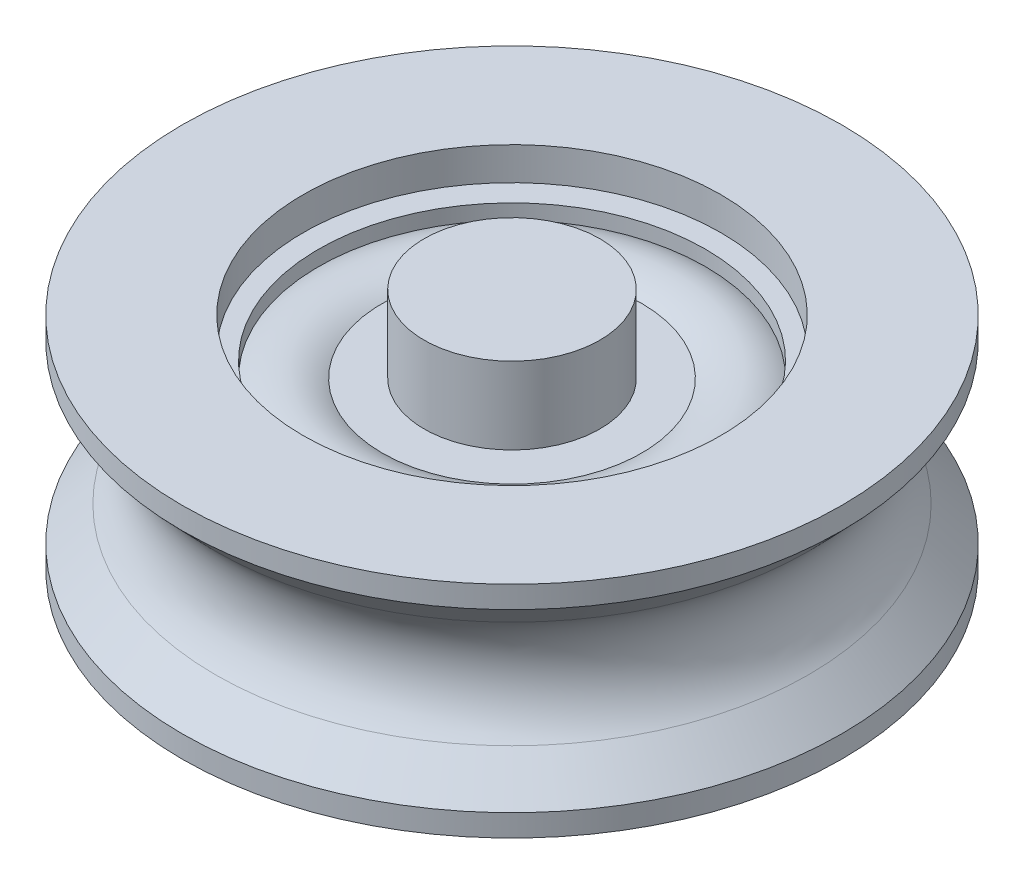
ISO-10303-21;
HEADER;
FILE_DESCRIPTION(('STEP AP214'),'2;1');
FILE_NAME('part.step','',(''),(''),'','','');
FILE_SCHEMA(('AUTOMOTIVE_DESIGN { 1 0 10303 214 1 1 1 1 }'));
ENDSEC;
DATA;
#1=APPLICATION_CONTEXT('core data for automotive mechanical design processes');
#2=APPLICATION_PROTOCOL_DEFINITION('international standard','automotive_design',2000,#1);
#3=PRODUCT_CONTEXT('',#1,'mechanical');
#4=PRODUCT('Part','Part','',(#3));
#5=PRODUCT_RELATED_PRODUCT_CATEGORY('part','',(#4));
#6=PRODUCT_DEFINITION_FORMATION('','',#4);
#7=PRODUCT_DEFINITION_CONTEXT('part definition',#1,'design');
#8=PRODUCT_DEFINITION('design','',#6,#7);
#9=PRODUCT_DEFINITION_SHAPE('','',#8);
#10=(LENGTH_UNIT() NAMED_UNIT(*) SI_UNIT(.MILLI.,.METRE.));
#11=(NAMED_UNIT(*) PLANE_ANGLE_UNIT() SI_UNIT($,.RADIAN.));
#12=(NAMED_UNIT(*) SI_UNIT($,.STERADIAN.) SOLID_ANGLE_UNIT());
#13=UNCERTAINTY_MEASURE_WITH_UNIT(LENGTH_MEASURE(1.E-05),#10,'distance_accuracy_value','');
#14=(GEOMETRIC_REPRESENTATION_CONTEXT(3) GLOBAL_UNCERTAINTY_ASSIGNED_CONTEXT((#13)) GLOBAL_UNIT_ASSIGNED_CONTEXT((#10,
#11,#12)) REPRESENTATION_CONTEXT('',''));
#15=CARTESIAN_POINT('',(0.,0.,0.));
#16=DIRECTION('',(0.,0.,1.));
#17=DIRECTION('',(1.,0.,0.));
#18=AXIS2_PLACEMENT_3D('',#15,#16,#17);
#19=CARTESIAN_POINT('',(0.,-4.48852632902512,0.));
#20=DIRECTION('',(0.,-1.,0.));
#21=DIRECTION('',(0.,0.,-1.));
#22=AXIS2_PLACEMENT_3D('',#19,#20,#21);
#23=PLANE('',#22);
#24=CARTESIAN_POINT('',(0.,-4.48852632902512,0.));
#25=DIRECTION('',(0.,-1.,0.));
#26=DIRECTION('',(0.,0.,-1.));
#27=AXIS2_PLACEMENT_3D('',#24,#25,#26);
#28=CIRCLE('',#27,4.);
#29=CARTESIAN_POINT('',(0.,-4.48852632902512,-4.));
#30=VERTEX_POINT('',#29);
#31=EDGE_CURVE('E18',#30,#30,#28,.F.);
#32=ORIENTED_EDGE('',*,*,#31,.F.);
#33=EDGE_LOOP('',(#32));
#34=FACE_BOUND('',#33,.T.);
#35=ADVANCED_FACE('F14',(#34),#23,.T.);
#36=CARTESIAN_POINT('',(-47.6713019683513,6.01147367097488,-52.2101334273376));
#37=DIRECTION('',(0.,-1.,0.));
#38=DIRECTION('',(0.,0.,-1.));
#39=AXIS2_PLACEMENT_3D('',#36,#37,#38);
#40=PLANE('',#39);
#41=CARTESIAN_POINT('',(0.,6.01147367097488,0.));
#42=DIRECTION('',(0.,-1.,0.));
#43=DIRECTION('',(0.,0.,-1.));
#44=AXIS2_PLACEMENT_3D('',#41,#42,#43);
#45=CIRCLE('',#44,4.);
#46=CARTESIAN_POINT('',(0.,6.01147367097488,-4.));
#47=VERTEX_POINT('',#46);
#48=EDGE_CURVE('E179',#47,#47,#45,.T.);
#49=ORIENTED_EDGE('',*,*,#48,.F.);
#50=EDGE_LOOP('',(#49));
#51=FACE_BOUND('',#50,.T.);
#52=ADVANCED_FACE('F87',(#51),#40,.F.);
#53=CARTESIAN_POINT('',(0.,0.76147367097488,0.));
#54=DIRECTION('',(0.,-1.,0.));
#55=DIRECTION('',(0.,0.,-1.));
#56=AXIS2_PLACEMENT_3D('',#53,#54,#55);
#57=CYLINDRICAL_SURFACE('',#56,4.);
#58=CARTESIAN_POINT('',(0.,-2.51147367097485,0.));
#59=DIRECTION('',(0.,-1.,0.));
#60=DIRECTION('',(0.,0.,-1.));
#61=AXIS2_PLACEMENT_3D('',#58,#59,#60);
#62=CIRCLE('',#61,4.);
#63=CARTESIAN_POINT('',(0.,-2.51147367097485,-4.));
#64=VERTEX_POINT('',#63);
#65=EDGE_CURVE('E177',#64,#64,#62,.F.);
#66=ORIENTED_EDGE('',*,*,#65,.F.);
#67=EDGE_LOOP('',(#66));
#68=FACE_BOUND('',#67,.T.);
#69=ORIENTED_EDGE('',*,*,#31,.T.);
#70=EDGE_LOOP('',(#69));
#71=FACE_BOUND('',#70,.T.);
#72=ADVANCED_FACE('F83',(#68,#71),#57,.T.);
#73=CARTESIAN_POINT('',(0.,0.76147367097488,0.));
#74=DIRECTION('',(0.,-1.,0.));
#75=DIRECTION('',(0.,0.,-1.));
#76=AXIS2_PLACEMENT_3D('',#73,#74,#75);
#77=CYLINDRICAL_SURFACE('',#76,4.);
#78=CARTESIAN_POINT('',(0.,2.51147367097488,0.));
#79=DIRECTION('',(0.,-1.,0.));
#80=DIRECTION('',(0.,0.,-1.));
#81=AXIS2_PLACEMENT_3D('',#78,#79,#80);
#82=CIRCLE('',#81,4.);
#83=CARTESIAN_POINT('',(0.,2.51147367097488,-4.));
#84=VERTEX_POINT('',#83);
#85=EDGE_CURVE('E174',#84,#84,#82,.T.);
#86=ORIENTED_EDGE('',*,*,#85,.F.);
#87=EDGE_LOOP('',(#86));
#88=FACE_BOUND('',#87,.T.);
#89=ORIENTED_EDGE('',*,*,#48,.T.);
#90=EDGE_LOOP('',(#89));
#91=FACE_BOUND('',#90,.T.);
#92=ADVANCED_FACE('F79',(#88,#91),#77,.T.);
#93=CARTESIAN_POINT('',(0.,-2.51147367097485,4.94999999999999));
#94=DIRECTION('',(0.,-1.,0.));
#95=DIRECTION('',(0.,0.,-1.));
#96=AXIS2_PLACEMENT_3D('',#93,#94,#95);
#97=PLANE('',#96);
#98=ORIENTED_EDGE('',*,*,#65,.T.);
#99=EDGE_LOOP('',(#98));
#100=FACE_BOUND('',#99,.T.);
#101=CARTESIAN_POINT('',(0.,-2.51147367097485,0.));
#102=DIRECTION('',(0.,-1.,0.));
#103=DIRECTION('',(0.,0.,-1.));
#104=AXIS2_PLACEMENT_3D('',#101,#102,#103);
#105=CIRCLE('',#104,5.89999999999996);
#106=CARTESIAN_POINT('',(0.,-2.51147367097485,-5.89999999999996));
#107=VERTEX_POINT('',#106);
#108=EDGE_CURVE('E171',#107,#107,#105,.F.);
#109=ORIENTED_EDGE('',*,*,#108,.F.);
#110=EDGE_LOOP('',(#109));
#111=FACE_BOUND('',#110,.T.);
#112=ADVANCED_FACE('F75',(#100,#111),#97,.T.);
#113=CARTESIAN_POINT('',(0.,2.51147367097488,4.95));
#114=DIRECTION('',(0.,1.,0.));
#115=DIRECTION('',(0.,0.,1.));
#116=AXIS2_PLACEMENT_3D('',#113,#114,#115);
#117=PLANE('',#116);
#118=ORIENTED_EDGE('',*,*,#85,.T.);
#119=EDGE_LOOP('',(#118));
#120=FACE_BOUND('',#119,.T.);
#121=CARTESIAN_POINT('',(0.,2.51147367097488,0.));
#122=DIRECTION('',(0.,-1.,0.));
#123=DIRECTION('',(0.,0.,-1.));
#124=AXIS2_PLACEMENT_3D('',#121,#122,#123);
#125=CIRCLE('',#124,5.9);
#126=CARTESIAN_POINT('',(0.,2.51147367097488,-5.9));
#127=VERTEX_POINT('',#126);
#128=EDGE_CURVE('E53',#127,#127,#125,.T.);
#129=ORIENTED_EDGE('',*,*,#128,.F.);
#130=EDGE_LOOP('',(#129));
#131=FACE_BOUND('',#130,.T.);
#132=ADVANCED_FACE('F71',(#120,#131),#117,.T.);
#133=CARTESIAN_POINT('',(0.,0.,0.));
#134=DIRECTION('',(0.,-1.,0.));
#135=DIRECTION('',(1.,0.,0.));
#136=AXIS2_PLACEMENT_3D('',#133,#134,#135);
#137=TOROIDAL_SURFACE('',#136,7.34999999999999,2.89999999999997);
#138=ORIENTED_EDGE('',*,*,#108,.T.);
#139=EDGE_LOOP('',(#138));
#140=FACE_BOUND('',#139,.T.);
#141=CARTESIAN_POINT('',(0.,-2.51147367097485,0.));
#142=DIRECTION('',(0.,-1.,0.));
#143=DIRECTION('',(0.,0.,-1.));
#144=AXIS2_PLACEMENT_3D('',#141,#142,#143);
#145=CIRCLE('',#144,8.79999999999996);
#146=CARTESIAN_POINT('',(0.,-2.51147367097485,-8.79999999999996));
#147=VERTEX_POINT('',#146);
#148=EDGE_CURVE('E48',#147,#147,#145,.T.);
#149=ORIENTED_EDGE('',*,*,#148,.T.);
#150=EDGE_LOOP('',(#149));
#151=FACE_BOUND('',#150,.T.);
#152=ADVANCED_FACE('F66',(#140,#151),#137,.T.);
#153=CARTESIAN_POINT('',(0.,0.,0.));
#154=DIRECTION('',(0.,-1.,0.));
#155=DIRECTION('',(1.,0.,0.));
#156=AXIS2_PLACEMENT_3D('',#153,#154,#155);
#157=TOROIDAL_SURFACE('',#156,7.34999999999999,2.89999999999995);
#158=CARTESIAN_POINT('',(0.,2.51147367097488,0.));
#159=DIRECTION('',(0.,-1.,0.));
#160=DIRECTION('',(0.,0.,-1.));
#161=AXIS2_PLACEMENT_3D('',#158,#159,#160);
#162=CIRCLE('',#161,8.79999999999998);
#163=CARTESIAN_POINT('',(0.,2.51147367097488,-8.79999999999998));
#164=VERTEX_POINT('',#163);
#165=EDGE_CURVE('E44',#164,#164,#162,.F.);
#166=ORIENTED_EDGE('',*,*,#165,.T.);
#167=EDGE_LOOP('',(#166));
#168=FACE_BOUND('',#167,.T.);
#169=ORIENTED_EDGE('',*,*,#128,.T.);
#170=EDGE_LOOP('',(#169));
#171=FACE_BOUND('',#170,.T.);
#172=ADVANCED_FACE('F61',(#168,#171),#157,.T.);
#173=CARTESIAN_POINT('',(0.,-2.85573683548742,0.));
#174=DIRECTION('',(0.,-1.,0.));
#175=DIRECTION('',(0.,0.,-1.));
#176=AXIS2_PLACEMENT_3D('',#173,#174,#175);
#177=CYLINDRICAL_SURFACE('',#176,8.79999999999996);
#178=CARTESIAN_POINT('',(0.,-3.19999999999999,0.));
#179=DIRECTION('',(0.,-1.,0.));
#180=DIRECTION('',(0.,0.,-1.));
#181=AXIS2_PLACEMENT_3D('',#178,#179,#180);
#182=CIRCLE('',#181,8.79999999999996);
#183=CARTESIAN_POINT('',(0.,-3.19999999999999,-8.79999999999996));
#184=VERTEX_POINT('',#183);
#185=EDGE_CURVE('E47',#184,#184,#182,.F.);
#186=ORIENTED_EDGE('',*,*,#185,.F.);
#187=EDGE_LOOP('',(#186));
#188=FACE_BOUND('',#187,.T.);
#189=ORIENTED_EDGE('',*,*,#148,.F.);
#190=EDGE_LOOP('',(#189));
#191=FACE_BOUND('',#190,.T.);
#192=ADVANCED_FACE('F65',(#188,#191),#177,.F.);
#193=CARTESIAN_POINT('',(0.,2.85573683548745,0.));
#194=DIRECTION('',(0.,-1.,0.));
#195=DIRECTION('',(0.,0.,-1.));
#196=AXIS2_PLACEMENT_3D('',#193,#194,#195);
#197=CYLINDRICAL_SURFACE('',#196,8.79999999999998);
#198=ORIENTED_EDGE('',*,*,#165,.F.);
#199=EDGE_LOOP('',(#198));
#200=FACE_BOUND('',#199,.T.);
#201=CARTESIAN_POINT('',(0.,3.20000000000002,0.));
#202=DIRECTION('',(0.,-1.,0.));
#203=DIRECTION('',(0.,0.,-1.));
#204=AXIS2_PLACEMENT_3D('',#201,#202,#203);
#205=CIRCLE('',#204,8.79999999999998);
#206=CARTESIAN_POINT('',(0.,3.20000000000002,-8.79999999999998));
#207=VERTEX_POINT('',#206);
#208=EDGE_CURVE('E164',#207,#207,#205,.T.);
#209=ORIENTED_EDGE('',*,*,#208,.F.);
#210=EDGE_LOOP('',(#209));
#211=FACE_BOUND('',#210,.T.);
#212=ADVANCED_FACE('F193',(#200,#211),#197,.F.);
#213=CARTESIAN_POINT('',(0.,-3.19999999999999,9.89999999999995));
#214=DIRECTION('',(0.,-1.,0.));
#215=DIRECTION('',(0.,0.,-1.));
#216=AXIS2_PLACEMENT_3D('',#213,#214,#215);
#217=PLANE('',#216);
#218=ORIENTED_EDGE('',*,*,#185,.T.);
#219=EDGE_LOOP('',(#218));
#220=FACE_BOUND('',#219,.T.);
#221=CARTESIAN_POINT('',(0.,-3.19999999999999,0.));
#222=DIRECTION('',(0.,-1.,0.));
#223=DIRECTION('',(0.,0.,-1.));
#224=AXIS2_PLACEMENT_3D('',#221,#222,#223);
#225=CIRCLE('',#224,10.9999999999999);
#226=CARTESIAN_POINT('',(0.,-3.19999999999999,-10.9999999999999));
#227=VERTEX_POINT('',#226);
#228=EDGE_CURVE('E161',#227,#227,#225,.F.);
#229=ORIENTED_EDGE('',*,*,#228,.F.);
#230=EDGE_LOOP('',(#229));
#231=FACE_BOUND('',#230,.T.);
#232=ADVANCED_FACE('F198',(#220,#231),#217,.T.);
#233=CARTESIAN_POINT('',(0.,3.20000000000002,9.89999999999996));
#234=DIRECTION('',(0.,1.,0.));
#235=DIRECTION('',(0.,0.,1.));
#236=AXIS2_PLACEMENT_3D('',#233,#234,#235);
#237=PLANE('',#236);
#238=ORIENTED_EDGE('',*,*,#208,.T.);
#239=EDGE_LOOP('',(#238));
#240=FACE_BOUND('',#239,.T.);
#241=CARTESIAN_POINT('',(0.,3.20000000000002,0.));
#242=DIRECTION('',(0.,-1.,0.));
#243=DIRECTION('',(0.,0.,-1.));
#244=AXIS2_PLACEMENT_3D('',#241,#242,#243);
#245=CIRCLE('',#244,11.);
#246=CARTESIAN_POINT('',(0.,3.20000000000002,-11.));
#247=VERTEX_POINT('',#246);
#248=EDGE_CURVE('E159',#247,#247,#245,.T.);
#249=ORIENTED_EDGE('',*,*,#248,.F.);
#250=EDGE_LOOP('',(#249));
#251=FACE_BOUND('',#250,.T.);
#252=ADVANCED_FACE('F98',(#240,#251),#237,.T.);
#253=CARTESIAN_POINT('',(0.,-3.19999999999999,0.));
#254=DIRECTION('',(0.,-1.,0.));
#255=DIRECTION('',(0.,0.,-1.));
#256=AXIS2_PLACEMENT_3D('',#253,#254,#255);
#257=TOROIDAL_SURFACE('',#256,10.6999999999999,0.299999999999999);
#258=CARTESIAN_POINT('',(0.,-3.49999999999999,0.));
#259=DIRECTION('',(0.,-1.,0.));
#260=DIRECTION('',(0.,0.,-1.));
#261=AXIS2_PLACEMENT_3D('',#258,#259,#260);
#262=CIRCLE('',#261,10.6999999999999);
#263=CARTESIAN_POINT('',(0.,-3.49999999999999,-10.6999999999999));
#264=VERTEX_POINT('',#263);
#265=EDGE_CURVE('E156',#264,#264,#262,.F.);
#266=ORIENTED_EDGE('',*,*,#265,.F.);
#267=EDGE_LOOP('',(#266));
#268=FACE_BOUND('',#267,.T.);
#269=ORIENTED_EDGE('',*,*,#228,.T.);
#270=EDGE_LOOP('',(#269));
#271=FACE_BOUND('',#270,.T.);
#272=ADVANCED_FACE('F95',(#268,#271),#257,.F.);
#273=CARTESIAN_POINT('',(0.,3.20000000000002,0.));
#274=DIRECTION('',(0.,-1.,0.));
#275=DIRECTION('',(0.,0.,-1.));
#276=AXIS2_PLACEMENT_3D('',#273,#274,#275);
#277=TOROIDAL_SURFACE('',#276,10.7,0.30000000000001);
#278=ORIENTED_EDGE('',*,*,#248,.T.);
#279=EDGE_LOOP('',(#278));
#280=FACE_BOUND('',#279,.T.);
#281=CARTESIAN_POINT('',(0.,3.50000000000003,0.));
#282=DIRECTION('',(0.,-1.,0.));
#283=DIRECTION('',(0.,0.,-1.));
#284=AXIS2_PLACEMENT_3D('',#281,#282,#283);
#285=CIRCLE('',#284,10.6999999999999);
#286=CARTESIAN_POINT('',(0.,3.50000000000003,-10.6999999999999));
#287=VERTEX_POINT('',#286);
#288=EDGE_CURVE('E153',#287,#287,#285,.T.);
#289=ORIENTED_EDGE('',*,*,#288,.F.);
#290=EDGE_LOOP('',(#289));
#291=FACE_BOUND('',#290,.T.);
#292=ADVANCED_FACE('F97',(#280,#291),#277,.F.);
#293=CARTESIAN_POINT('',(0.,-3.5,10.0999999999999));
#294=DIRECTION('',(0.,1.,0.));
#295=DIRECTION('',(0.,0.,1.));
#296=AXIS2_PLACEMENT_3D('',#293,#294,#295);
#297=PLANE('',#296);
#298=CARTESIAN_POINT('',(0.,-3.5,0.));
#299=DIRECTION('',(0.,-1.,0.));
#300=DIRECTION('',(0.,0.,-1.));
#301=AXIS2_PLACEMENT_3D('',#298,#299,#300);
#302=CIRCLE('',#301,9.49999999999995);
#303=CARTESIAN_POINT('',(0.,-3.5,-9.49999999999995));
#304=VERTEX_POINT('',#303);
#305=EDGE_CURVE('E150',#304,#304,#302,.T.);
#306=ORIENTED_EDGE('',*,*,#305,.T.);
#307=EDGE_LOOP('',(#306));
#308=FACE_BOUND('',#307,.T.);
#309=ORIENTED_EDGE('',*,*,#265,.T.);
#310=EDGE_LOOP('',(#309));
#311=FACE_BOUND('',#310,.T.);
#312=ADVANCED_FACE('F101',(#308,#311),#297,.T.);
#313=CARTESIAN_POINT('',(0.,3.5,10.1));
#314=DIRECTION('',(0.,-1.,0.));
#315=DIRECTION('',(0.,0.,-1.));
#316=AXIS2_PLACEMENT_3D('',#313,#314,#315);
#317=PLANE('',#316);
#318=CARTESIAN_POINT('',(0.,3.5,0.));
#319=DIRECTION('',(0.,-1.,0.));
#320=DIRECTION('',(0.,0.,-1.));
#321=AXIS2_PLACEMENT_3D('',#318,#319,#320);
#322=CIRCLE('',#321,9.49999999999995);
#323=CARTESIAN_POINT('',(0.,3.5,-9.49999999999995));
#324=VERTEX_POINT('',#323);
#325=EDGE_CURVE('E147',#324,#324,#322,.F.);
#326=ORIENTED_EDGE('',*,*,#325,.T.);
#327=EDGE_LOOP('',(#326));
#328=FACE_BOUND('',#327,.T.);
#329=ORIENTED_EDGE('',*,*,#288,.T.);
#330=EDGE_LOOP('',(#329));
#331=FACE_BOUND('',#330,.T.);
#332=ADVANCED_FACE('F107',(#328,#331),#317,.T.);
#333=CARTESIAN_POINT('',(0.,-4.25,0.));
#334=DIRECTION('',(0.,-1.,0.));
#335=DIRECTION('',(0.,0.,-1.));
#336=AXIS2_PLACEMENT_3D('',#333,#334,#335);
#337=CYLINDRICAL_SURFACE('',#336,9.49999999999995);
#338=CARTESIAN_POINT('',(0.,-5.,0.));
#339=DIRECTION('',(0.,-1.,0.));
#340=DIRECTION('',(0.,0.,-1.));
#341=AXIS2_PLACEMENT_3D('',#338,#339,#340);
#342=CIRCLE('',#341,9.49999999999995);
#343=CARTESIAN_POINT('',(0.,-5.,-9.49999999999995));
#344=VERTEX_POINT('',#343);
#345=EDGE_CURVE('E142',#344,#344,#342,.F.);
#346=ORIENTED_EDGE('',*,*,#345,.F.);
#347=EDGE_LOOP('',(#346));
#348=FACE_BOUND('',#347,.T.);
#349=ORIENTED_EDGE('',*,*,#305,.F.);
#350=EDGE_LOOP('',(#349));
#351=FACE_BOUND('',#350,.T.);
#352=ADVANCED_FACE('F215',(#348,#351),#337,.F.);
#353=CARTESIAN_POINT('',(0.,4.25,0.));
#354=DIRECTION('',(0.,-1.,0.));
#355=DIRECTION('',(0.,0.,-1.));
#356=AXIS2_PLACEMENT_3D('',#353,#354,#355);
#357=CYLINDRICAL_SURFACE('',#356,9.49999999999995);
#358=ORIENTED_EDGE('',*,*,#325,.F.);
#359=EDGE_LOOP('',(#358));
#360=FACE_BOUND('',#359,.T.);
#361=CARTESIAN_POINT('',(0.,5.,0.));
#362=DIRECTION('',(0.,-1.,0.));
#363=DIRECTION('',(0.,0.,-1.));
#364=AXIS2_PLACEMENT_3D('',#361,#362,#363);
#365=CIRCLE('',#364,9.49999999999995);
#366=CARTESIAN_POINT('',(0.,5.,-9.49999999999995));
#367=VERTEX_POINT('',#366);
#368=EDGE_CURVE('E138',#367,#367,#365,.T.);
#369=ORIENTED_EDGE('',*,*,#368,.F.);
#370=EDGE_LOOP('',(#369));
#371=FACE_BOUND('',#370,.T.);
#372=ADVANCED_FACE('F219',(#360,#371),#357,.F.);
#373=CARTESIAN_POINT('',(0.,-5.,12.2499999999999));
#374=DIRECTION('',(0.,-1.,0.));
#375=DIRECTION('',(0.,0.,-1.));
#376=AXIS2_PLACEMENT_3D('',#373,#374,#375);
#377=PLANE('',#376);
#378=ORIENTED_EDGE('',*,*,#345,.T.);
#379=EDGE_LOOP('',(#378));
#380=FACE_BOUND('',#379,.T.);
#381=CARTESIAN_POINT('',(0.,-5.,0.));
#382=DIRECTION('',(0.,-1.,0.));
#383=DIRECTION('',(0.,0.,-1.));
#384=AXIS2_PLACEMENT_3D('',#381,#382,#383);
#385=CIRCLE('',#384,15.);
#386=CARTESIAN_POINT('',(0.,-5.,-15.));
#387=VERTEX_POINT('',#386);
#388=EDGE_CURVE('E136',#387,#387,#385,.F.);
#389=ORIENTED_EDGE('',*,*,#388,.F.);
#390=EDGE_LOOP('',(#389));
#391=FACE_BOUND('',#390,.T.);
#392=ADVANCED_FACE('F223',(#380,#391),#377,.T.);
#393=CARTESIAN_POINT('',(0.,5.,12.2499999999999));
#394=DIRECTION('',(0.,1.,0.));
#395=DIRECTION('',(0.,0.,1.));
#396=AXIS2_PLACEMENT_3D('',#393,#394,#395);
#397=PLANE('',#396);
#398=ORIENTED_EDGE('',*,*,#368,.T.);
#399=EDGE_LOOP('',(#398));
#400=FACE_BOUND('',#399,.T.);
#401=CARTESIAN_POINT('',(0.,5.,0.));
#402=DIRECTION('',(0.,-1.,0.));
#403=DIRECTION('',(0.,0.,-1.));
#404=AXIS2_PLACEMENT_3D('',#401,#402,#403);
#405=CIRCLE('',#404,15.);
#406=CARTESIAN_POINT('',(0.,5.,-15.));
#407=VERTEX_POINT('',#406);
#408=EDGE_CURVE('E41',#407,#407,#405,.T.);
#409=ORIENTED_EDGE('',*,*,#408,.F.);
#410=EDGE_LOOP('',(#409));
#411=FACE_BOUND('',#410,.T.);
#412=ADVANCED_FACE('F132',(#400,#411),#397,.T.);
#413=CARTESIAN_POINT('',(0.,-4.5,0.));
#414=DIRECTION('',(0.,-1.,0.));
#415=DIRECTION('',(0.,0.,-1.));
#416=AXIS2_PLACEMENT_3D('',#413,#414,#415);
#417=CYLINDRICAL_SURFACE('',#416,15.);
#418=CARTESIAN_POINT('',(0.,-4.0000000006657,0.));
#419=DIRECTION('',(0.,-1.,0.));
#420=DIRECTION('',(0.,0.,1.));
#421=AXIS2_PLACEMENT_3D('',#418,#419,#420);
#422=CIRCLE('',#421,14.9999999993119);
#423=CARTESIAN_POINT('',(0.,-4.0000000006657,14.9999999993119));
#424=VERTEX_POINT('',#423);
#425=EDGE_CURVE('E36',#424,#424,#422,.F.);
#426=ORIENTED_EDGE('',*,*,#425,.F.);
#427=EDGE_LOOP('',(#426));
#428=FACE_BOUND('',#427,.T.);
#429=ORIENTED_EDGE('',*,*,#388,.T.);
#430=EDGE_LOOP('',(#429));
#431=FACE_BOUND('',#430,.T.);
#432=ADVANCED_FACE('F129',(#428,#431),#417,.T.);
#433=CARTESIAN_POINT('',(0.,4.49999999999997,0.));
#434=DIRECTION('',(0.,-1.,0.));
#435=DIRECTION('',(0.,0.,-1.));
#436=AXIS2_PLACEMENT_3D('',#433,#434,#435);
#437=CYLINDRICAL_SURFACE('',#436,15.);
#438=ORIENTED_EDGE('',*,*,#408,.T.);
#439=EDGE_LOOP('',(#438));
#440=FACE_BOUND('',#439,.T.);
#441=CARTESIAN_POINT('',(0.,4.00000000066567,0.));
#442=DIRECTION('',(0.,1.,0.));
#443=DIRECTION('',(0.,0.,1.));
#444=AXIS2_PLACEMENT_3D('',#441,#442,#443);
#445=CIRCLE('',#444,14.9999999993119);
#446=CARTESIAN_POINT('',(0.,4.00000000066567,14.9999999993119));
#447=VERTEX_POINT('',#446);
#448=EDGE_CURVE('E27',#447,#447,#445,.F.);
#449=ORIENTED_EDGE('',*,*,#448,.F.);
#450=EDGE_LOOP('',(#449));
#451=FACE_BOUND('',#450,.T.);
#452=ADVANCED_FACE('F125',(#440,#451),#437,.T.);
#453=CARTESIAN_POINT('',(0.,-4.0000000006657,0.));
#454=DIRECTION('',(0.,-1.,0.));
#455=DIRECTION('',(0.,0.,-1.));
#456=AXIS2_PLACEMENT_3D('',#453,#454,#455);
#457=CONICAL_SURFACE('',#456,14.9999999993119,0.768874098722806);
#458=CARTESIAN_POINT('',(0.,-2.43364275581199,0.));
#459=DIRECTION('',(0.,1.,0.));
#460=DIRECTION('',(0.,0.,1.));
#461=AXIS2_PLACEMENT_3D('',#458,#459,#460);
#462=CIRCLE('',#461,13.4845710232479);
#463=CARTESIAN_POINT('',(0.,-2.43364275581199,13.4845710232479));
#464=VERTEX_POINT('',#463);
#465=EDGE_CURVE('E22',#464,#464,#462,.T.);
#466=ORIENTED_EDGE('',*,*,#465,.F.);
#467=EDGE_LOOP('',(#466));
#468=FACE_BOUND('',#467,.T.);
#469=ORIENTED_EDGE('',*,*,#425,.T.);
#470=EDGE_LOOP('',(#469));
#471=FACE_BOUND('',#470,.T.);
#472=ADVANCED_FACE('F117',(#468,#471),#457,.T.);
#473=CARTESIAN_POINT('',(0.,4.00000000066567,0.));
#474=DIRECTION('',(0.,1.,0.));
#475=DIRECTION('',(0.,0.,1.));
#476=AXIS2_PLACEMENT_3D('',#473,#474,#475);
#477=CONICAL_SURFACE('',#476,14.9999999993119,0.768874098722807);
#478=ORIENTED_EDGE('',*,*,#448,.T.);
#479=EDGE_LOOP('',(#478));
#480=FACE_BOUND('',#479,.T.);
#481=CARTESIAN_POINT('',(0.,2.433642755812,0.));
#482=DIRECTION('',(0.,-1.,0.));
#483=DIRECTION('',(0.,0.,-1.));
#484=AXIS2_PLACEMENT_3D('',#481,#482,#483);
#485=CIRCLE('',#484,13.4845710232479);
#486=CARTESIAN_POINT('',(0.,2.433642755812,-13.4845710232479));
#487=VERTEX_POINT('',#486);
#488=EDGE_CURVE('E10',#487,#487,#485,.T.);
#489=ORIENTED_EDGE('',*,*,#488,.F.);
#490=EDGE_LOOP('',(#489));
#491=FACE_BOUND('',#490,.T.);
#492=ADVANCED_FACE('F113',(#480,#491),#477,.T.);
#493=CARTESIAN_POINT('',(0.,0.,0.));
#494=DIRECTION('',(0.,-1.,0.));
#495=DIRECTION('',(0.,0.,-1.));
#496=AXIS2_PLACEMENT_3D('',#493,#494,#495);
#497=TOROIDAL_SURFACE('',#496,16.,3.5);
#498=ORIENTED_EDGE('',*,*,#488,.T.);
#499=EDGE_LOOP('',(#498));
#500=FACE_BOUND('',#499,.T.);
#501=ORIENTED_EDGE('',*,*,#465,.T.);
#502=EDGE_LOOP('',(#501));
#503=FACE_BOUND('',#502,.T.);
#504=ADVANCED_FACE('F16',(#500,#503),#497,.F.);
#505=CLOSED_SHELL('',(#35,#52,#72,#92,#112,#132,#152,#172,#192,#212,#232,#252,#272,#292,#312,
#332,#352,#372,#392,#412,#432,#452,#472,#492,#504));
#506=MANIFOLD_SOLID_BREP('B1',#505);
#507=ADVANCED_BREP_SHAPE_REPRESENTATION('',(#18,#506),#14);
#508=SHAPE_DEFINITION_REPRESENTATION(#9,#507);
ENDSEC;
END-ISO-10303-21;
